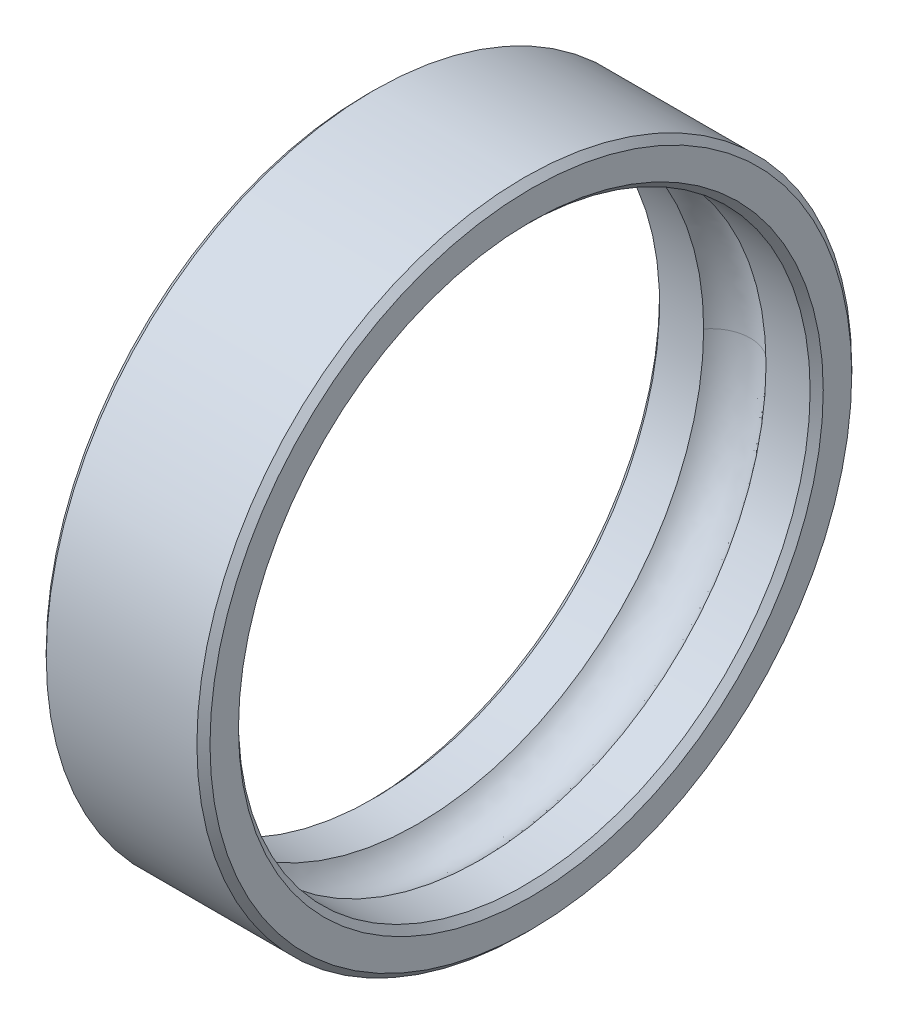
ISO-10303-21;
HEADER;
FILE_DESCRIPTION(('STEP AP214'),'2;1');
FILE_NAME('part.step','',(''),(''),'','','');
FILE_SCHEMA(('AUTOMOTIVE_DESIGN { 1 0 10303 214 1 1 1 1 }'));
ENDSEC;
DATA;
#1=APPLICATION_CONTEXT('core data for automotive mechanical design processes');
#2=APPLICATION_PROTOCOL_DEFINITION('international standard','automotive_design',2000,#1);
#3=PRODUCT_CONTEXT('',#1,'mechanical');
#4=PRODUCT('Part','Part','',(#3));
#5=PRODUCT_RELATED_PRODUCT_CATEGORY('part','',(#4));
#6=PRODUCT_DEFINITION_FORMATION('','',#4);
#7=PRODUCT_DEFINITION_CONTEXT('part definition',#1,'design');
#8=PRODUCT_DEFINITION('design','',#6,#7);
#9=PRODUCT_DEFINITION_SHAPE('','',#8);
#10=(LENGTH_UNIT() NAMED_UNIT(*) SI_UNIT(.MILLI.,.METRE.));
#11=(NAMED_UNIT(*) PLANE_ANGLE_UNIT() SI_UNIT($,.RADIAN.));
#12=(NAMED_UNIT(*) SI_UNIT($,.STERADIAN.) SOLID_ANGLE_UNIT());
#13=UNCERTAINTY_MEASURE_WITH_UNIT(LENGTH_MEASURE(1.E-05),#10,'distance_accuracy_value','');
#14=(GEOMETRIC_REPRESENTATION_CONTEXT(3) GLOBAL_UNCERTAINTY_ASSIGNED_CONTEXT((#13)) GLOBAL_UNIT_ASSIGNED_CONTEXT((#10,
#11,#12)) REPRESENTATION_CONTEXT('',''));
#15=CARTESIAN_POINT('',(0.,0.,0.));
#16=DIRECTION('',(0.,0.,1.));
#17=DIRECTION('',(1.,0.,0.));
#18=AXIS2_PLACEMENT_3D('',#15,#16,#17);
#19=CARTESIAN_POINT('',(-1.25,-4.9588,4.9588));
#20=DIRECTION('',(1.,0.,0.));
#21=DIRECTION('',(0.,0.,-1.));
#22=AXIS2_PLACEMENT_3D('',#19,#20,#21);
#23=PLANE('',#22);
#24=CARTESIAN_POINT('',(-1.25000000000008,0.,0.));
#25=DIRECTION('',(-1.,0.,0.));
#26=DIRECTION('',(0.,0.,1.));
#27=AXIS2_PLACEMENT_3D('',#24,#25,#26);
#28=CIRCLE('',#27,4.46500000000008);
#29=CARTESIAN_POINT('',(-1.25000000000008,0.,4.46500000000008));
#30=VERTEX_POINT('',#29);
#31=EDGE_CURVE('E21',#30,#30,#28,.T.);
#32=ORIENTED_EDGE('',*,*,#31,.F.);
#33=EDGE_LOOP('',(#32));
#34=FACE_BOUND('',#33,.T.);
#35=CARTESIAN_POINT('',(-1.24999999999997,0.,0.));
#36=DIRECTION('',(1.,0.,0.));
#37=DIRECTION('',(0.,1.,0.));
#38=AXIS2_PLACEMENT_3D('',#35,#36,#37);
#39=CIRCLE('',#38,4.90000000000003);
#40=CARTESIAN_POINT('',(-1.24999999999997,4.90000000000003,0.));
#41=VERTEX_POINT('',#40);
#42=EDGE_CURVE('E53',#41,#41,#39,.F.);
#43=ORIENTED_EDGE('',*,*,#42,.T.);
#44=EDGE_LOOP('',(#43));
#45=FACE_BOUND('',#44,.T.);
#46=ADVANCED_FACE('F17',(#34,#45),#23,.F.);
#47=CARTESIAN_POINT('',(-1.15,0.,0.));
#48=DIRECTION('',(-1.,0.,0.));
#49=DIRECTION('',(0.,0.,1.));
#50=AXIS2_PLACEMENT_3D('',#47,#48,#49);
#51=CONICAL_SURFACE('',#50,4.365,0.785398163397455);
#52=CARTESIAN_POINT('',(-1.15,0.,0.));
#53=DIRECTION('',(-1.,0.,0.));
#54=DIRECTION('',(0.,0.,1.));
#55=AXIS2_PLACEMENT_3D('',#52,#53,#54);
#56=CIRCLE('',#55,4.365);
#57=CARTESIAN_POINT('',(-1.15,0.,4.365));
#58=VERTEX_POINT('',#57);
#59=EDGE_CURVE('E63',#58,#58,#56,.T.);
#60=ORIENTED_EDGE('',*,*,#59,.F.);
#61=EDGE_LOOP('',(#60));
#62=FACE_BOUND('',#61,.T.);
#63=ORIENTED_EDGE('',*,*,#31,.T.);
#64=EDGE_LOOP('',(#63));
#65=FACE_BOUND('',#64,.T.);
#66=ADVANCED_FACE('F94',(#62,#65),#51,.F.);
#67=CARTESIAN_POINT('',(-1.25,0.,0.));
#68=DIRECTION('',(1.,0.,0.));
#69=DIRECTION('',(0.,1.,0.));
#70=AXIS2_PLACEMENT_3D('',#67,#68,#69);
#71=CONICAL_SURFACE('',#70,4.9,0.785398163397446);
#72=ORIENTED_EDGE('',*,*,#42,.F.);
#73=EDGE_LOOP('',(#72));
#74=FACE_BOUND('',#73,.T.);
#75=CARTESIAN_POINT('',(-1.15,0.,0.));
#76=DIRECTION('',(-1.,0.,0.));
#77=DIRECTION('',(0.,0.,1.));
#78=AXIS2_PLACEMENT_3D('',#75,#76,#77);
#79=CIRCLE('',#78,5.);
#80=CARTESIAN_POINT('',(-1.15,0.,5.));
#81=VERTEX_POINT('',#80);
#82=EDGE_CURVE('E66',#81,#81,#79,.T.);
#83=ORIENTED_EDGE('',*,*,#82,.T.);
#84=EDGE_LOOP('',(#83));
#85=FACE_BOUND('',#84,.T.);
#86=ADVANCED_FACE('F102',(#74,#85),#71,.T.);
#87=CARTESIAN_POINT('',(-0.476208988,0.,4.365));
#88=CARTESIAN_POINT('',(-0.476208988,8.73,4.365));
#89=CARTESIAN_POINT('',(-0.476208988,8.73,-4.365));
#90=CARTESIAN_POINT('',(-0.476208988,0.,-4.365));
#91=CARTESIAN_POINT('',(-0.214831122,0.,4.706015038));
#92=CARTESIAN_POINT('',(-0.214831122,9.412030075,4.706015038));
#93=CARTESIAN_POINT('',(-0.214831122,9.412030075,-4.706015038));
#94=CARTESIAN_POINT('',(-0.214831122,0.,-4.706015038));
#95=CARTESIAN_POINT('',(0.214831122,0.,4.706015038));
#96=CARTESIAN_POINT('',(0.214831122,9.412030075,4.706015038));
#97=CARTESIAN_POINT('',(0.214831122,9.412030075,-4.706015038));
#98=CARTESIAN_POINT('',(0.214831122,0.,-4.706015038));
#99=CARTESIAN_POINT('',(0.476208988,0.,4.365));
#100=CARTESIAN_POINT('',(0.476208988,8.73,4.365));
#101=CARTESIAN_POINT('',(0.476208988,8.73,-4.365));
#102=CARTESIAN_POINT('',(0.476208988,0.,-4.365));
#103=(BOUNDED_SURFACE() B_SPLINE_SURFACE(3,3,((#87,#88,#89,#90),(#91,#92,#93,#94),(#95,#96,#97,
#98),(#99,#100,#101,#102)),.UNSPECIFIED.,.F.,.F.,.F.) B_SPLINE_SURFACE_WITH_KNOTS((4,4),(4,4),
(0.,1.),(0.,1.),.UNSPECIFIED.) GEOMETRIC_REPRESENTATION_ITEM() RATIONAL_B_SPLINE_SURFACE(((1.,
0.333333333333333,0.333333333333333,1.),(0.738888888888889,0.246296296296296,0.246296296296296,
0.738888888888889),(0.738888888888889,0.246296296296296,0.246296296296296,0.738888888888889),
(1.,0.333333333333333,0.333333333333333,1.))) REPRESENTATION_ITEM('') SURFACE());
#104=CARTESIAN_POINT('',(0.476208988,0.,0.));
#105=DIRECTION('',(-1.,0.,0.));
#106=DIRECTION('',(0.,0.,1.));
#107=AXIS2_PLACEMENT_3D('',#104,#105,#106);
#108=CIRCLE('',#107,4.365);
#109=CARTESIAN_POINT('',(0.476208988,0.,4.365));
#110=VERTEX_POINT('',#109);
#111=CARTESIAN_POINT('',(0.476208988,-8.95276465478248E-10,-4.365));
#112=VERTEX_POINT('',#111);
#113=EDGE_CURVE('E60',#110,#112,#108,.T.);
#114=CARTESIAN_POINT('',(-0.476208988,0.,4.365));
#115=CARTESIAN_POINT('',(-0.214831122,0.,4.706015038));
#116=CARTESIAN_POINT('',(0.214831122,0.,4.706015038));
#117=CARTESIAN_POINT('',(0.476208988,0.,4.365));
#118=(BOUNDED_CURVE() B_SPLINE_CURVE(3,(#114,#115,#116,#117),.UNSPECIFIED.,.F.,
.F.) B_SPLINE_CURVE_WITH_KNOTS((4,4),(0.,1.),
.UNSPECIFIED.) CURVE() GEOMETRIC_REPRESENTATION_ITEM() RATIONAL_B_SPLINE_CURVE((1.,
0.738888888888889,0.738888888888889,1.)) REPRESENTATION_ITEM(''));
#119=CARTESIAN_POINT('',(-0.476208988,-9.79872970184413E-11,4.365));
#120=VERTEX_POINT('',#119);
#121=EDGE_CURVE('E44',#120,#110,#118,.T.);
#122=CARTESIAN_POINT('',(-0.476208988,0.,0.));
#123=DIRECTION('',(1.,0.,0.));
#124=DIRECTION('',(0.,0.,-1.));
#125=AXIS2_PLACEMENT_3D('',#122,#123,#124);
#126=CIRCLE('',#125,4.365);
#127=CARTESIAN_POINT('',(-0.476208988,-4.47638232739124E-10,-4.365));
#128=VERTEX_POINT('',#127);
#129=EDGE_CURVE('E47',#128,#120,#126,.T.);
#130=CARTESIAN_POINT('',(-0.476208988,0.,-4.365));
#131=CARTESIAN_POINT('',(-0.214831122,0.,-4.706015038));
#132=CARTESIAN_POINT('',(0.214831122,0.,-4.706015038));
#133=CARTESIAN_POINT('',(0.476208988,0.,-4.365));
#134=(BOUNDED_CURVE() B_SPLINE_CURVE(3,(#130,#131,#132,#133),.UNSPECIFIED.,.F.,
.F.) B_SPLINE_CURVE_WITH_KNOTS((4,4),(0.,1.),
.UNSPECIFIED.) CURVE() GEOMETRIC_REPRESENTATION_ITEM() RATIONAL_B_SPLINE_CURVE((1.,
0.738888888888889,0.738888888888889,1.)) REPRESENTATION_ITEM(''));
#135=EDGE_CURVE('E51',#112,#128,#134,.F.);
#136=ORIENTED_EDGE('',*,*,#113,.F.);
#137=ORIENTED_EDGE('',*,*,#121,.F.);
#138=ORIENTED_EDGE('',*,*,#129,.F.);
#139=ORIENTED_EDGE('',*,*,#135,.F.);
#140=EDGE_LOOP('',(#136,#137,#138,#139));
#141=FACE_BOUND('',#140,.T.);
#142=ADVANCED_FACE('F49',(#141),#103,.F.);
#143=CARTESIAN_POINT('',(-0.476208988,0.,0.));
#144=DIRECTION('',(-1.,0.,0.));
#145=DIRECTION('',(0.,0.,1.));
#146=AXIS2_PLACEMENT_3D('',#143,#144,#145);
#147=CYLINDRICAL_SURFACE('',#146,4.365);
#148=CARTESIAN_POINT('',(-0.476208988,0.,0.));
#149=DIRECTION('',(1.,0.,0.));
#150=DIRECTION('',(0.,0.,-1.));
#151=AXIS2_PLACEMENT_3D('',#148,#149,#150);
#152=CIRCLE('',#151,4.365);
#153=EDGE_CURVE('E55',#120,#128,#152,.T.);
#154=ORIENTED_EDGE('',*,*,#153,.T.);
#155=ORIENTED_EDGE('',*,*,#129,.T.);
#156=EDGE_LOOP('',(#154,#155));
#157=FACE_BOUND('',#156,.T.);
#158=ORIENTED_EDGE('',*,*,#59,.T.);
#159=EDGE_LOOP('',(#158));
#160=FACE_BOUND('',#159,.T.);
#161=ADVANCED_FACE('F56',(#157,#160),#147,.F.);
#162=CARTESIAN_POINT('',(1.15,0.,0.));
#163=DIRECTION('',(-1.,0.,0.));
#164=DIRECTION('',(0.,0.,1.));
#165=AXIS2_PLACEMENT_3D('',#162,#163,#164);
#166=CYLINDRICAL_SURFACE('',#165,5.);
#167=CARTESIAN_POINT('',(1.14999999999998,0.,0.));
#168=DIRECTION('',(-1.,0.,0.));
#169=DIRECTION('',(0.,0.,1.));
#170=AXIS2_PLACEMENT_3D('',#167,#168,#169);
#171=CIRCLE('',#170,5.);
#172=CARTESIAN_POINT('',(1.15,0.,5.));
#173=VERTEX_POINT('',#172);
#174=EDGE_CURVE('E59',#173,#173,#171,.T.);
#175=ORIENTED_EDGE('',*,*,#174,.T.);
#176=EDGE_LOOP('',(#175));
#177=FACE_BOUND('',#176,.T.);
#178=ORIENTED_EDGE('',*,*,#82,.F.);
#179=EDGE_LOOP('',(#178));
#180=FACE_BOUND('',#179,.T.);
#181=ADVANCED_FACE('F129',(#177,#180),#166,.T.);
#182=CARTESIAN_POINT('',(-0.476208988,0.,-4.365));
#183=CARTESIAN_POINT('',(-0.476208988,-8.73,-4.365));
#184=CARTESIAN_POINT('',(-0.476208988,-8.73,4.365));
#185=CARTESIAN_POINT('',(-0.476208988,0.,4.365));
#186=CARTESIAN_POINT('',(-0.214831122,0.,-4.706015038));
#187=CARTESIAN_POINT('',(-0.214831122,-9.412030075,-4.706015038));
#188=CARTESIAN_POINT('',(-0.214831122,-9.412030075,4.706015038));
#189=CARTESIAN_POINT('',(-0.214831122,0.,4.706015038));
#190=CARTESIAN_POINT('',(0.214831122,0.,-4.706015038));
#191=CARTESIAN_POINT('',(0.214831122,-9.412030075,-4.706015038));
#192=CARTESIAN_POINT('',(0.214831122,-9.412030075,4.706015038));
#193=CARTESIAN_POINT('',(0.214831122,0.,4.706015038));
#194=CARTESIAN_POINT('',(0.476208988,0.,-4.365));
#195=CARTESIAN_POINT('',(0.476208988,-8.73,-4.365));
#196=CARTESIAN_POINT('',(0.476208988,-8.73,4.365));
#197=CARTESIAN_POINT('',(0.476208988,0.,4.365));
#198=(BOUNDED_SURFACE() B_SPLINE_SURFACE(3,3,((#182,#183,#184,#185),(#186,#187,#188,#189),(#190,
#191,#192,#193),(#194,#195,#196,#197)),.UNSPECIFIED.,.F.,.F.,
.F.) B_SPLINE_SURFACE_WITH_KNOTS((4,4),(4,4),(0.,1.),(0.,1.),
.UNSPECIFIED.) GEOMETRIC_REPRESENTATION_ITEM() RATIONAL_B_SPLINE_SURFACE(((1.,0.333333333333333,
0.333333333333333,1.),(0.738888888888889,0.246296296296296,0.246296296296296,0.738888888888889),
(0.738888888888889,0.246296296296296,0.246296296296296,0.738888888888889),(1.,0.333333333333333,
0.333333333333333,1.))) REPRESENTATION_ITEM('') SURFACE());
#199=CARTESIAN_POINT('',(0.476208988,0.,0.));
#200=DIRECTION('',(-1.,0.,0.));
#201=DIRECTION('',(0.,0.,1.));
#202=AXIS2_PLACEMENT_3D('',#199,#200,#201);
#203=CIRCLE('',#202,4.365);
#204=EDGE_CURVE('E35',#112,#110,#203,.T.);
#205=ORIENTED_EDGE('',*,*,#135,.T.);
#206=ORIENTED_EDGE('',*,*,#153,.F.);
#207=ORIENTED_EDGE('',*,*,#121,.T.);
#208=ORIENTED_EDGE('',*,*,#204,.F.);
#209=EDGE_LOOP('',(#205,#206,#207,#208));
#210=FACE_BOUND('',#209,.T.);
#211=ADVANCED_FACE('F62',(#210),#198,.F.);
#212=CARTESIAN_POINT('',(1.25,0.,0.));
#213=DIRECTION('',(-1.,0.,0.));
#214=DIRECTION('',(0.,-1.,0.));
#215=AXIS2_PLACEMENT_3D('',#212,#213,#214);
#216=CONICAL_SURFACE('',#215,4.9,0.785398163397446);
#217=CARTESIAN_POINT('',(1.24999999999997,0.,0.));
#218=DIRECTION('',(-1.,0.,0.));
#219=DIRECTION('',(0.,-1.,0.));
#220=AXIS2_PLACEMENT_3D('',#217,#218,#219);
#221=CIRCLE('',#220,4.90000000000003);
#222=CARTESIAN_POINT('',(1.24999999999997,-4.90000000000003,0.));
#223=VERTEX_POINT('',#222);
#224=EDGE_CURVE('E86',#223,#223,#221,.T.);
#225=ORIENTED_EDGE('',*,*,#224,.T.);
#226=EDGE_LOOP('',(#225));
#227=FACE_BOUND('',#226,.T.);
#228=ORIENTED_EDGE('',*,*,#174,.F.);
#229=EDGE_LOOP('',(#228));
#230=FACE_BOUND('',#229,.T.);
#231=ADVANCED_FACE('F120',(#227,#230),#216,.T.);
#232=CARTESIAN_POINT('',(1.15,0.,0.));
#233=DIRECTION('',(-1.,0.,0.));
#234=DIRECTION('',(0.,0.,1.));
#235=AXIS2_PLACEMENT_3D('',#232,#233,#234);
#236=CYLINDRICAL_SURFACE('',#235,4.365);
#237=CARTESIAN_POINT('',(1.14999999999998,0.,0.));
#238=DIRECTION('',(1.,0.,0.));
#239=DIRECTION('',(0.,0.,-1.));
#240=AXIS2_PLACEMENT_3D('',#237,#238,#239);
#241=CIRCLE('',#240,4.365);
#242=CARTESIAN_POINT('',(1.15,0.,-4.365));
#243=VERTEX_POINT('',#242);
#244=EDGE_CURVE('E27',#243,#243,#241,.F.);
#245=ORIENTED_EDGE('',*,*,#244,.F.);
#246=EDGE_LOOP('',(#245));
#247=FACE_BOUND('',#246,.T.);
#248=ORIENTED_EDGE('',*,*,#204,.T.);
#249=ORIENTED_EDGE('',*,*,#113,.T.);
#250=EDGE_LOOP('',(#248,#249));
#251=FACE_BOUND('',#250,.T.);
#252=ADVANCED_FACE('F113',(#247,#251),#236,.F.);
#253=CARTESIAN_POINT('',(1.25,-4.9588,-4.9588));
#254=DIRECTION('',(-1.,0.,0.));
#255=DIRECTION('',(0.,0.,1.));
#256=AXIS2_PLACEMENT_3D('',#253,#254,#255);
#257=PLANE('',#256);
#258=CARTESIAN_POINT('',(1.24999999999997,0.,0.));
#259=DIRECTION('',(1.,0.,0.));
#260=DIRECTION('',(0.,0.,-1.));
#261=AXIS2_PLACEMENT_3D('',#258,#259,#260);
#262=CIRCLE('',#261,4.46499999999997);
#263=CARTESIAN_POINT('',(1.24999999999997,0.,-4.46499999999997));
#264=VERTEX_POINT('',#263);
#265=EDGE_CURVE('E11',#264,#264,#262,.T.);
#266=ORIENTED_EDGE('',*,*,#265,.F.);
#267=EDGE_LOOP('',(#266));
#268=FACE_BOUND('',#267,.T.);
#269=ORIENTED_EDGE('',*,*,#224,.F.);
#270=EDGE_LOOP('',(#269));
#271=FACE_BOUND('',#270,.T.);
#272=ADVANCED_FACE('F19',(#268,#271),#257,.F.);
#273=CARTESIAN_POINT('',(1.15,0.,0.));
#274=DIRECTION('',(1.,0.,0.));
#275=DIRECTION('',(0.,0.,-1.));
#276=AXIS2_PLACEMENT_3D('',#273,#274,#275);
#277=CONICAL_SURFACE('',#276,4.365,0.785398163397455);
#278=ORIENTED_EDGE('',*,*,#244,.T.);
#279=EDGE_LOOP('',(#278));
#280=FACE_BOUND('',#279,.T.);
#281=ORIENTED_EDGE('',*,*,#265,.T.);
#282=EDGE_LOOP('',(#281));
#283=FACE_BOUND('',#282,.T.);
#284=ADVANCED_FACE('F106',(#280,#283),#277,.F.);
#285=CLOSED_SHELL('',(#46,#66,#86,#142,#161,#181,#211,#231,#252,#272,#284));
#286=MANIFOLD_SOLID_BREP('B1',#285);
#287=ADVANCED_BREP_SHAPE_REPRESENTATION('',(#18,#286),#14);
#288=SHAPE_DEFINITION_REPRESENTATION(#9,#287);
ENDSEC;
END-ISO-10303-21;
